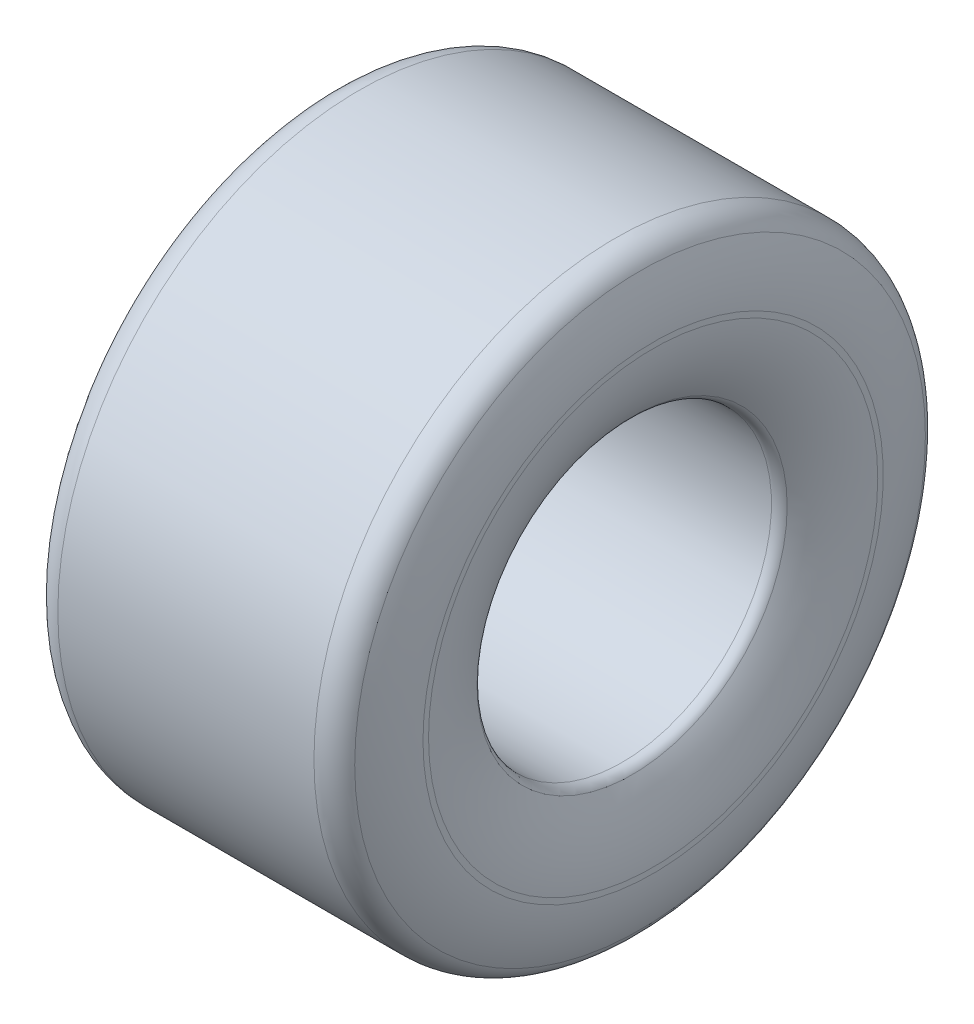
from build123d import *


with BuildPart() as part:
    # Sketch1 → Revolve1 (revolve)
    with BuildSketch(Plane.XY, mode=Mode.PRIVATE) as revolve1_sk:
        with BuildLine():
            Line((61.9125, 68.58), (-61.9125, 68.58))
            ThreePointArc((-61.9125, 68.58), (-64.562871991, 69.25973395), (-66.558961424, 71.131133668))
            ThreePointArc((-66.558961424, 71.131133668), (-73.569821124, 86.415233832), (-76.2, 103.023606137))
            Line((-76.2, 103.023606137), (-76.2, 105.563606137))
            ThreePointArc((-76.2, 105.563606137), (-74.54828331, 118.539425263), (-70.201891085, 130.876723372))
            ThreePointArc((-70.201891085, 130.876723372), (-65.51593504, 136.152277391), (-58.7375, 138.1125))
            Line((-58.7375, 138.1125), (58.7375, 138.1125))
            ThreePointArc((58.7375, 138.1125), (65.51593504, 136.152277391), (70.201891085, 130.876723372))
            ThreePointArc((70.201891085, 130.876723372), (74.54828331, 118.539425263), (76.2, 105.563606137))
            Line((76.2, 105.563606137), (76.2, 103.023606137))
            ThreePointArc((76.2, 103.023606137), (73.569821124, 86.415233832), (66.558961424, 71.131133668))
            ThreePointArc((66.558961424, 71.131133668), (64.562871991, 69.25973395), (61.9125, 68.58))
        make_face()
    revolve(revolve1_sk.sketch.rotate(Axis((0, 0, 0), (1, 0, 0)), 90), axis=Axis((0, 0, 0), (1, 0, 0)))


solid = part.part
